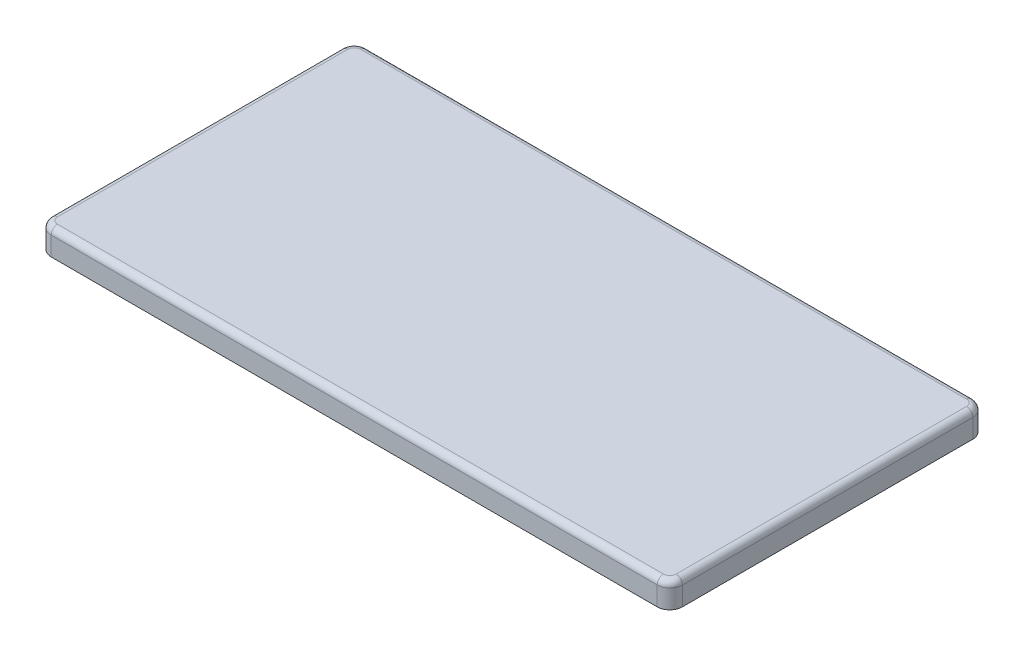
ISO-10303-21;
HEADER;
FILE_DESCRIPTION(('STEP AP214'),'2;1');
FILE_NAME('part.step','',(''),(''),'','','');
FILE_SCHEMA(('AUTOMOTIVE_DESIGN { 1 0 10303 214 1 1 1 1 }'));
ENDSEC;
DATA;
#1=APPLICATION_CONTEXT('core data for automotive mechanical design processes');
#2=APPLICATION_PROTOCOL_DEFINITION('international standard','automotive_design',2000,#1);
#3=PRODUCT_CONTEXT('',#1,'mechanical');
#4=PRODUCT('Part','Part','',(#3));
#5=PRODUCT_RELATED_PRODUCT_CATEGORY('part','',(#4));
#6=PRODUCT_DEFINITION_FORMATION('','',#4);
#7=PRODUCT_DEFINITION_CONTEXT('part definition',#1,'design');
#8=PRODUCT_DEFINITION('design','',#6,#7);
#9=PRODUCT_DEFINITION_SHAPE('','',#8);
#10=(LENGTH_UNIT() NAMED_UNIT(*) SI_UNIT(.MILLI.,.METRE.));
#11=(NAMED_UNIT(*) PLANE_ANGLE_UNIT() SI_UNIT($,.RADIAN.));
#12=(NAMED_UNIT(*) SI_UNIT($,.STERADIAN.) SOLID_ANGLE_UNIT());
#13=UNCERTAINTY_MEASURE_WITH_UNIT(LENGTH_MEASURE(1.E-05),#10,'distance_accuracy_value','');
#14=(GEOMETRIC_REPRESENTATION_CONTEXT(3) GLOBAL_UNCERTAINTY_ASSIGNED_CONTEXT((#13)) GLOBAL_UNIT_ASSIGNED_CONTEXT((#10,
#11,#12)) REPRESENTATION_CONTEXT('',''));
#15=CARTESIAN_POINT('',(0.,0.,0.));
#16=DIRECTION('',(0.,0.,1.));
#17=DIRECTION('',(1.,0.,0.));
#18=AXIS2_PLACEMENT_3D('',#15,#16,#17);
#19=CARTESIAN_POINT('',(-47.2,0.,22.2));
#20=DIRECTION('',(0.,-1.,0.));
#21=DIRECTION('',(0.,0.,-1.));
#22=AXIS2_PLACEMENT_3D('',#19,#20,#21);
#23=PLANE('',#22);
#24=DIRECTION('',(0.707106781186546,0.,0.707106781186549));
#25=VECTOR('',#24,1.);
#26=CARTESIAN_POINT('',(-29.2928932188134,0.,-3.7476659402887));
#27=LINE('',#26,#25);
#28=CARTESIAN_POINT('',(-29.2928932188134,0.,-3.7476659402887));
#29=VERTEX_POINT('',#28);
#30=CARTESIAN_POINT('',(-26.2523340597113,0.,-0.707106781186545));
#31=VERTEX_POINT('',#30);
#32=EDGE_CURVE('E283',#29,#31,#27,.T.);
#33=ORIENTED_EDGE('',*,*,#32,.F.);
#34=DIRECTION('',(0.707106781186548,0.,-0.707106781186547));
#35=VECTOR('',#34,1.);
#36=CARTESIAN_POINT('',(-33.7476659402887,0.,0.707106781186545));
#37=LINE('',#36,#35);
#38=CARTESIAN_POINT('',(-33.7476659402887,0.,0.707106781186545));
#39=VERTEX_POINT('',#38);
#40=EDGE_CURVE('E257',#39,#29,#37,.T.);
#41=ORIENTED_EDGE('',*,*,#40,.F.);
#42=DIRECTION('',(-0.707106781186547,0.,-0.707106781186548));
#43=VECTOR('',#42,1.);
#44=CARTESIAN_POINT('',(-33.7476659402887,0.,0.707106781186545));
#45=LINE('',#44,#43);
#46=CARTESIAN_POINT('',(-30.7071067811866,0.,3.7476659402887));
#47=VERTEX_POINT('',#46);
#48=EDGE_CURVE('E289',#47,#39,#45,.T.);
#49=ORIENTED_EDGE('',*,*,#48,.F.);
#50=DIRECTION('',(-0.707106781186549,0.,0.707106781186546));
#51=VECTOR('',#50,1.);
#52=CARTESIAN_POINT('',(-30.7071067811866,0.,3.7476659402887));
#53=LINE('',#52,#51);
#54=EDGE_CURVE('E286',#31,#47,#53,.T.);
#55=ORIENTED_EDGE('',*,*,#54,.F.);
#56=EDGE_LOOP('',(#33,#41,#49,#55));
#57=FACE_BOUND('',#56,.T.);
#58=CARTESIAN_POINT('',(-47.2,0.,22.2));
#59=DIRECTION('',(0.,-1.,0.));
#60=DIRECTION('',(0.,0.,-1.));
#61=AXIS2_PLACEMENT_3D('',#58,#59,#60);
#62=CIRCLE('',#61,0.8);
#63=CARTESIAN_POINT('',(-47.2,0.,23.));
#64=VERTEX_POINT('',#63);
#65=CARTESIAN_POINT('',(-48.,0.,22.2));
#66=VERTEX_POINT('',#65);
#67=EDGE_CURVE('E301',#64,#66,#62,.T.);
#68=ORIENTED_EDGE('',*,*,#67,.T.);
#69=DIRECTION('',(0.,0.,-1.));
#70=VECTOR('',#69,1.);
#71=CARTESIAN_POINT('',(-48.,0.,22.2));
#72=LINE('',#71,#70);
#73=CARTESIAN_POINT('',(-48.,0.,-22.2));
#74=VERTEX_POINT('',#73);
#75=EDGE_CURVE('E304',#66,#74,#72,.T.);
#76=ORIENTED_EDGE('',*,*,#75,.T.);
#77=CARTESIAN_POINT('',(-47.2,0.,-22.2));
#78=DIRECTION('',(0.,-1.,0.));
#79=DIRECTION('',(0.,0.,-1.));
#80=AXIS2_PLACEMENT_3D('',#77,#78,#79);
#81=CIRCLE('',#80,0.800000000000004);
#82=CARTESIAN_POINT('',(-47.2,0.,-23.));
#83=VERTEX_POINT('',#82);
#84=EDGE_CURVE('E308',#74,#83,#81,.T.);
#85=ORIENTED_EDGE('',*,*,#84,.T.);
#86=DIRECTION('',(1.,0.,0.));
#87=VECTOR('',#86,1.);
#88=CARTESIAN_POINT('',(-47.2,0.,-23.));
#89=LINE('',#88,#87);
#90=CARTESIAN_POINT('',(47.2,0.,-23.));
#91=VERTEX_POINT('',#90);
#92=EDGE_CURVE('E311',#83,#91,#89,.T.);
#93=ORIENTED_EDGE('',*,*,#92,.T.);
#94=CARTESIAN_POINT('',(47.2,0.,-22.2));
#95=DIRECTION('',(0.,-1.,0.));
#96=DIRECTION('',(0.,0.,-1.));
#97=AXIS2_PLACEMENT_3D('',#94,#95,#96);
#98=CIRCLE('',#97,0.800000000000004);
#99=CARTESIAN_POINT('',(48.,0.,-22.2));
#100=VERTEX_POINT('',#99);
#101=EDGE_CURVE('E314',#91,#100,#98,.T.);
#102=ORIENTED_EDGE('',*,*,#101,.T.);
#103=DIRECTION('',(0.,0.,1.));
#104=VECTOR('',#103,1.);
#105=CARTESIAN_POINT('',(48.,0.,22.2));
#106=LINE('',#105,#104);
#107=CARTESIAN_POINT('',(48.,0.,22.2));
#108=VERTEX_POINT('',#107);
#109=EDGE_CURVE('E317',#100,#108,#106,.T.);
#110=ORIENTED_EDGE('',*,*,#109,.T.);
#111=CARTESIAN_POINT('',(47.2,0.,22.2));
#112=DIRECTION('',(0.,-1.,0.));
#113=DIRECTION('',(0.,0.,-1.));
#114=AXIS2_PLACEMENT_3D('',#111,#112,#113);
#115=CIRCLE('',#114,0.799999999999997);
#116=CARTESIAN_POINT('',(47.2,0.,23.));
#117=VERTEX_POINT('',#116);
#118=EDGE_CURVE('E320',#108,#117,#115,.T.);
#119=ORIENTED_EDGE('',*,*,#118,.T.);
#120=DIRECTION('',(-1.,0.,0.));
#121=VECTOR('',#120,1.);
#122=CARTESIAN_POINT('',(-47.2,0.,23.));
#123=LINE('',#122,#121);
#124=EDGE_CURVE('E323',#117,#64,#123,.T.);
#125=ORIENTED_EDGE('',*,*,#124,.T.);
#126=EDGE_LOOP('',(#68,#76,#85,#93,#102,#110,#119,#125));
#127=FACE_BOUND('',#126,.T.);
#128=DIRECTION('',(0.707106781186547,0.,0.707106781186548));
#129=VECTOR('',#128,1.);
#130=CARTESIAN_POINT('',(30.7071067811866,0.,-3.7476659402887));
#131=LINE('',#130,#129);
#132=CARTESIAN_POINT('',(30.7071067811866,0.,-3.7476659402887));
#133=VERTEX_POINT('',#132);
#134=CARTESIAN_POINT('',(33.7476659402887,0.,-0.707106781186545));
#135=VERTEX_POINT('',#134);
#136=EDGE_CURVE('E251',#133,#135,#131,.T.);
#137=ORIENTED_EDGE('',*,*,#136,.F.);
#138=DIRECTION('',(0.707106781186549,0.,-0.707106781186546));
#139=VECTOR('',#138,1.);
#140=CARTESIAN_POINT('',(26.2523340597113,0.,0.707106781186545));
#141=LINE('',#140,#139);
#142=CARTESIAN_POINT('',(26.2523340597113,0.,0.707106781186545));
#143=VERTEX_POINT('',#142);
#144=EDGE_CURVE('E261',#143,#133,#141,.T.);
#145=ORIENTED_EDGE('',*,*,#144,.F.);
#146=DIRECTION('',(-0.707106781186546,0.,-0.707106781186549));
#147=VECTOR('',#146,1.);
#148=CARTESIAN_POINT('',(26.2523340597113,0.,0.707106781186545));
#149=LINE('',#148,#147);
#150=CARTESIAN_POINT('',(29.2928932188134,0.,3.74766594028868));
#151=VERTEX_POINT('',#150);
#152=EDGE_CURVE('E273',#151,#143,#149,.T.);
#153=ORIENTED_EDGE('',*,*,#152,.F.);
#154=DIRECTION('',(-0.707106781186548,0.,0.707106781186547));
#155=VECTOR('',#154,1.);
#156=CARTESIAN_POINT('',(29.2928932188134,0.,3.7476659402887));
#157=LINE('',#156,#155);
#158=EDGE_CURVE('E271',#135,#151,#157,.T.);
#159=ORIENTED_EDGE('',*,*,#158,.F.);
#160=EDGE_LOOP('',(#137,#145,#153,#159));
#161=FACE_BOUND('',#160,.T.);
#162=ADVANCED_FACE('F36',(#57,#127,#161),#23,.T.);
#163=CARTESIAN_POINT('',(-48.,2.,-23.));
#164=DIRECTION('',(0.,-1.,0.));
#165=DIRECTION('',(0.,0.,-1.));
#166=AXIS2_PLACEMENT_3D('',#163,#164,#165);
#167=CYLINDRICAL_SURFACE('',#166,2.);
#168=DIRECTION('',(0.,-1.,0.));
#169=VECTOR('',#168,1.);
#170=CARTESIAN_POINT('',(-50.,2.,-23.));
#171=LINE('',#170,#169);
#172=CARTESIAN_POINT('',(-50.,1.,-23.));
#173=VERTEX_POINT('',#172);
#174=CARTESIAN_POINT('',(-50.,-2.,-23.));
#175=VERTEX_POINT('',#174);
#176=EDGE_CURVE('E404',#173,#175,#171,.T.);
#177=ORIENTED_EDGE('',*,*,#176,.F.);
#178=CARTESIAN_POINT('',(-48.,1.,-23.));
#179=DIRECTION('',(0.,1.,0.));
#180=DIRECTION('',(0.,0.,1.));
#181=AXIS2_PLACEMENT_3D('',#178,#179,#180);
#182=CIRCLE('',#181,2.);
#183=CARTESIAN_POINT('',(-48.,1.,-25.));
#184=VERTEX_POINT('',#183);
#185=EDGE_CURVE('E428',#173,#184,#182,.F.);
#186=ORIENTED_EDGE('',*,*,#185,.T.);
#187=DIRECTION('',(0.,-1.,0.));
#188=VECTOR('',#187,1.);
#189=CARTESIAN_POINT('',(-48.,2.,-25.));
#190=LINE('',#189,#188);
#191=CARTESIAN_POINT('',(-48.,-2.,-25.));
#192=VERTEX_POINT('',#191);
#193=EDGE_CURVE('E390',#184,#192,#190,.T.);
#194=ORIENTED_EDGE('',*,*,#193,.T.);
#195=CARTESIAN_POINT('',(-48.,-2.,-23.));
#196=DIRECTION('',(0.,1.,0.));
#197=DIRECTION('',(0.,0.,1.));
#198=AXIS2_PLACEMENT_3D('',#195,#196,#197);
#199=CIRCLE('',#198,2.);
#200=EDGE_CURVE('E365',#192,#175,#199,.T.);
#201=ORIENTED_EDGE('',*,*,#200,.T.);
#202=EDGE_LOOP('',(#177,#186,#194,#201));
#203=FACE_BOUND('',#202,.T.);
#204=ADVANCED_FACE('F544',(#203),#167,.T.);
#205=CARTESIAN_POINT('',(-50.,2.,23.));
#206=DIRECTION('',(1.,0.,0.));
#207=DIRECTION('',(0.,0.,-1.));
#208=AXIS2_PLACEMENT_3D('',#205,#206,#207);
#209=PLANE('',#208);
#210=DIRECTION('',(0.,-1.,0.));
#211=VECTOR('',#210,1.);
#212=CARTESIAN_POINT('',(-50.,2.,23.));
#213=LINE('',#212,#211);
#214=CARTESIAN_POINT('',(-50.,1.,23.));
#215=VERTEX_POINT('',#214);
#216=CARTESIAN_POINT('',(-50.,-2.,23.));
#217=VERTEX_POINT('',#216);
#218=EDGE_CURVE('E402',#215,#217,#213,.T.);
#219=ORIENTED_EDGE('',*,*,#218,.F.);
#220=DIRECTION('',(0.,0.,1.));
#221=VECTOR('',#220,1.);
#222=CARTESIAN_POINT('',(-50.,1.,-23.));
#223=LINE('',#222,#221);
#224=EDGE_CURVE('E426',#215,#173,#223,.F.);
#225=ORIENTED_EDGE('',*,*,#224,.T.);
#226=ORIENTED_EDGE('',*,*,#176,.T.);
#227=DIRECTION('',(0.,0.,1.));
#228=VECTOR('',#227,1.);
#229=CARTESIAN_POINT('',(-50.,-2.,23.));
#230=LINE('',#229,#228);
#231=EDGE_CURVE('E368',#175,#217,#230,.T.);
#232=ORIENTED_EDGE('',*,*,#231,.T.);
#233=EDGE_LOOP('',(#219,#225,#226,#232));
#234=FACE_BOUND('',#233,.T.);
#235=ADVANCED_FACE('F550',(#234),#209,.F.);
#236=CARTESIAN_POINT('',(-48.,2.,23.));
#237=DIRECTION('',(0.,-1.,0.));
#238=DIRECTION('',(0.,0.,-1.));
#239=AXIS2_PLACEMENT_3D('',#236,#237,#238);
#240=CYLINDRICAL_SURFACE('',#239,2.);
#241=DIRECTION('',(0.,-1.,0.));
#242=VECTOR('',#241,1.);
#243=CARTESIAN_POINT('',(-48.,2.,25.));
#244=LINE('',#243,#242);
#245=CARTESIAN_POINT('',(-48.,1.,25.));
#246=VERTEX_POINT('',#245);
#247=CARTESIAN_POINT('',(-48.,-2.,25.));
#248=VERTEX_POINT('',#247);
#249=EDGE_CURVE('E400',#246,#248,#244,.T.);
#250=ORIENTED_EDGE('',*,*,#249,.F.);
#251=CARTESIAN_POINT('',(-48.,1.,23.));
#252=DIRECTION('',(0.,1.,0.));
#253=DIRECTION('',(0.,0.,1.));
#254=AXIS2_PLACEMENT_3D('',#251,#252,#253);
#255=CIRCLE('',#254,2.);
#256=EDGE_CURVE('E423',#246,#215,#255,.F.);
#257=ORIENTED_EDGE('',*,*,#256,.T.);
#258=ORIENTED_EDGE('',*,*,#218,.T.);
#259=CARTESIAN_POINT('',(-48.,-2.,23.));
#260=DIRECTION('',(0.,1.,0.));
#261=DIRECTION('',(0.,0.,1.));
#262=AXIS2_PLACEMENT_3D('',#259,#260,#261);
#263=CIRCLE('',#262,2.);
#264=EDGE_CURVE('E372',#217,#248,#263,.T.);
#265=ORIENTED_EDGE('',*,*,#264,.T.);
#266=EDGE_LOOP('',(#250,#257,#258,#265));
#267=FACE_BOUND('',#266,.T.);
#268=ADVANCED_FACE('F620',(#267),#240,.T.);
#269=CARTESIAN_POINT('',(-48.,2.,25.));
#270=DIRECTION('',(0.,0.,-1.));
#271=DIRECTION('',(-1.,0.,0.));
#272=AXIS2_PLACEMENT_3D('',#269,#270,#271);
#273=PLANE('',#272);
#274=DIRECTION('',(0.,-1.,0.));
#275=VECTOR('',#274,1.);
#276=CARTESIAN_POINT('',(48.,2.,25.));
#277=LINE('',#276,#275);
#278=CARTESIAN_POINT('',(48.,1.,25.));
#279=VERTEX_POINT('',#278);
#280=CARTESIAN_POINT('',(48.,-2.,25.));
#281=VERTEX_POINT('',#280);
#282=EDGE_CURVE('E398',#279,#281,#277,.T.);
#283=ORIENTED_EDGE('',*,*,#282,.F.);
#284=DIRECTION('',(1.,0.,0.));
#285=VECTOR('',#284,1.);
#286=CARTESIAN_POINT('',(-48.,1.,25.));
#287=LINE('',#286,#285);
#288=EDGE_CURVE('E438',#279,#246,#287,.F.);
#289=ORIENTED_EDGE('',*,*,#288,.T.);
#290=ORIENTED_EDGE('',*,*,#249,.T.);
#291=DIRECTION('',(1.,0.,0.));
#292=VECTOR('',#291,1.);
#293=CARTESIAN_POINT('',(-48.,-2.,25.));
#294=LINE('',#293,#292);
#295=EDGE_CURVE('E375',#248,#281,#294,.T.);
#296=ORIENTED_EDGE('',*,*,#295,.T.);
#297=EDGE_LOOP('',(#283,#289,#290,#296));
#298=FACE_BOUND('',#297,.T.);
#299=ADVANCED_FACE('F616',(#298),#273,.F.);
#300=CARTESIAN_POINT('',(48.,2.,23.));
#301=DIRECTION('',(0.,-1.,0.));
#302=DIRECTION('',(0.,0.,-1.));
#303=AXIS2_PLACEMENT_3D('',#300,#301,#302);
#304=CYLINDRICAL_SURFACE('',#303,2.);
#305=DIRECTION('',(0.,-1.,0.));
#306=VECTOR('',#305,1.);
#307=CARTESIAN_POINT('',(50.,2.,23.));
#308=LINE('',#307,#306);
#309=CARTESIAN_POINT('',(50.,1.,23.));
#310=VERTEX_POINT('',#309);
#311=CARTESIAN_POINT('',(50.,-2.,23.));
#312=VERTEX_POINT('',#311);
#313=EDGE_CURVE('E396',#310,#312,#308,.T.);
#314=ORIENTED_EDGE('',*,*,#313,.F.);
#315=CARTESIAN_POINT('',(48.,1.,23.));
#316=DIRECTION('',(0.,1.,0.));
#317=DIRECTION('',(0.,0.,1.));
#318=AXIS2_PLACEMENT_3D('',#315,#316,#317);
#319=CIRCLE('',#318,2.);
#320=EDGE_CURVE('E436',#310,#279,#319,.F.);
#321=ORIENTED_EDGE('',*,*,#320,.T.);
#322=ORIENTED_EDGE('',*,*,#282,.T.);
#323=CARTESIAN_POINT('',(48.,-2.,23.));
#324=DIRECTION('',(0.,1.,0.));
#325=DIRECTION('',(0.,0.,1.));
#326=AXIS2_PLACEMENT_3D('',#323,#324,#325);
#327=CIRCLE('',#326,2.);
#328=EDGE_CURVE('E378',#281,#312,#327,.T.);
#329=ORIENTED_EDGE('',*,*,#328,.T.);
#330=EDGE_LOOP('',(#314,#321,#322,#329));
#331=FACE_BOUND('',#330,.T.);
#332=ADVANCED_FACE('F612',(#331),#304,.T.);
#333=CARTESIAN_POINT('',(50.,2.,23.));
#334=DIRECTION('',(-1.,0.,0.));
#335=DIRECTION('',(0.,0.,1.));
#336=AXIS2_PLACEMENT_3D('',#333,#334,#335);
#337=PLANE('',#336);
#338=DIRECTION('',(0.,-1.,0.));
#339=VECTOR('',#338,1.);
#340=CARTESIAN_POINT('',(50.,2.,-23.));
#341=LINE('',#340,#339);
#342=CARTESIAN_POINT('',(50.,1.,-23.));
#343=VERTEX_POINT('',#342);
#344=CARTESIAN_POINT('',(50.,-2.,-23.));
#345=VERTEX_POINT('',#344);
#346=EDGE_CURVE('E394',#343,#345,#341,.T.);
#347=ORIENTED_EDGE('',*,*,#346,.F.);
#348=DIRECTION('',(0.,0.,-1.));
#349=VECTOR('',#348,1.);
#350=CARTESIAN_POINT('',(50.,1.,23.));
#351=LINE('',#350,#349);
#352=EDGE_CURVE('E434',#343,#310,#351,.F.);
#353=ORIENTED_EDGE('',*,*,#352,.T.);
#354=ORIENTED_EDGE('',*,*,#313,.T.);
#355=DIRECTION('',(0.,0.,-1.));
#356=VECTOR('',#355,1.);
#357=CARTESIAN_POINT('',(50.,-2.,23.));
#358=LINE('',#357,#356);
#359=EDGE_CURVE('E381',#312,#345,#358,.T.);
#360=ORIENTED_EDGE('',*,*,#359,.T.);
#361=EDGE_LOOP('',(#347,#353,#354,#360));
#362=FACE_BOUND('',#361,.T.);
#363=ADVANCED_FACE('F608',(#362),#337,.F.);
#364=CARTESIAN_POINT('',(48.,2.,-23.));
#365=DIRECTION('',(0.,-1.,0.));
#366=DIRECTION('',(0.,0.,-1.));
#367=AXIS2_PLACEMENT_3D('',#364,#365,#366);
#368=CYLINDRICAL_SURFACE('',#367,2.);
#369=DIRECTION('',(0.,-1.,0.));
#370=VECTOR('',#369,1.);
#371=CARTESIAN_POINT('',(48.,2.,-25.));
#372=LINE('',#371,#370);
#373=CARTESIAN_POINT('',(48.,1.,-25.));
#374=VERTEX_POINT('',#373);
#375=CARTESIAN_POINT('',(48.,-2.,-25.));
#376=VERTEX_POINT('',#375);
#377=EDGE_CURVE('E392',#374,#376,#372,.T.);
#378=ORIENTED_EDGE('',*,*,#377,.F.);
#379=CARTESIAN_POINT('',(48.,1.,-23.));
#380=DIRECTION('',(0.,1.,0.));
#381=DIRECTION('',(0.,0.,1.));
#382=AXIS2_PLACEMENT_3D('',#379,#380,#381);
#383=CIRCLE('',#382,2.);
#384=EDGE_CURVE('E432',#374,#343,#383,.F.);
#385=ORIENTED_EDGE('',*,*,#384,.T.);
#386=ORIENTED_EDGE('',*,*,#346,.T.);
#387=CARTESIAN_POINT('',(48.,-2.,-23.));
#388=DIRECTION('',(0.,1.,0.));
#389=DIRECTION('',(0.,0.,1.));
#390=AXIS2_PLACEMENT_3D('',#387,#388,#389);
#391=CIRCLE('',#390,2.);
#392=EDGE_CURVE('E384',#345,#376,#391,.T.);
#393=ORIENTED_EDGE('',*,*,#392,.T.);
#394=EDGE_LOOP('',(#378,#385,#386,#393));
#395=FACE_BOUND('',#394,.T.);
#396=ADVANCED_FACE('F604',(#395),#368,.T.);
#397=CARTESIAN_POINT('',(-48.,2.,-25.));
#398=DIRECTION('',(0.,0.,1.));
#399=DIRECTION('',(1.,0.,0.));
#400=AXIS2_PLACEMENT_3D('',#397,#398,#399);
#401=PLANE('',#400);
#402=ORIENTED_EDGE('',*,*,#193,.F.);
#403=DIRECTION('',(-1.,0.,0.));
#404=VECTOR('',#403,1.);
#405=CARTESIAN_POINT('',(48.,1.,-25.));
#406=LINE('',#405,#404);
#407=EDGE_CURVE('E430',#184,#374,#406,.F.);
#408=ORIENTED_EDGE('',*,*,#407,.T.);
#409=ORIENTED_EDGE('',*,*,#377,.T.);
#410=DIRECTION('',(-1.,0.,0.));
#411=VECTOR('',#410,1.);
#412=CARTESIAN_POINT('',(-48.,-2.,-25.));
#413=LINE('',#412,#411);
#414=EDGE_CURVE('E387',#376,#192,#413,.T.);
#415=ORIENTED_EDGE('',*,*,#414,.T.);
#416=EDGE_LOOP('',(#402,#408,#409,#415));
#417=FACE_BOUND('',#416,.T.);
#418=ADVANCED_FACE('F596',(#417),#401,.F.);
#419=CARTESIAN_POINT('',(-48.,2.,-23.));
#420=DIRECTION('',(0.,1.,0.));
#421=DIRECTION('',(0.,0.,1.));
#422=AXIS2_PLACEMENT_3D('',#419,#420,#421);
#423=PLANE('',#422);
#424=DIRECTION('',(0.,0.,1.));
#425=VECTOR('',#424,1.);
#426=CARTESIAN_POINT('',(-49.,2.,23.));
#427=LINE('',#426,#425);
#428=CARTESIAN_POINT('',(-49.,2.,-23.));
#429=VERTEX_POINT('',#428);
#430=CARTESIAN_POINT('',(-49.,2.,23.));
#431=VERTEX_POINT('',#430);
#432=EDGE_CURVE('E418',#429,#431,#427,.T.);
#433=ORIENTED_EDGE('',*,*,#432,.T.);
#434=CARTESIAN_POINT('',(-48.,2.,23.));
#435=DIRECTION('',(0.,1.,0.));
#436=DIRECTION('',(0.,0.,1.));
#437=AXIS2_PLACEMENT_3D('',#434,#435,#436);
#438=CIRCLE('',#437,1.);
#439=CARTESIAN_POINT('',(-48.,2.,24.));
#440=VERTEX_POINT('',#439);
#441=EDGE_CURVE('E420',#431,#440,#438,.T.);
#442=ORIENTED_EDGE('',*,*,#441,.T.);
#443=DIRECTION('',(1.,0.,0.));
#444=VECTOR('',#443,1.);
#445=CARTESIAN_POINT('',(48.,2.,24.));
#446=LINE('',#445,#444);
#447=CARTESIAN_POINT('',(48.,2.,24.));
#448=VERTEX_POINT('',#447);
#449=EDGE_CURVE('E406',#440,#448,#446,.T.);
#450=ORIENTED_EDGE('',*,*,#449,.T.);
#451=CARTESIAN_POINT('',(48.,2.,23.));
#452=DIRECTION('',(0.,1.,0.));
#453=DIRECTION('',(0.,0.,1.));
#454=AXIS2_PLACEMENT_3D('',#451,#452,#453);
#455=CIRCLE('',#454,1.);
#456=CARTESIAN_POINT('',(49.,2.,23.));
#457=VERTEX_POINT('',#456);
#458=EDGE_CURVE('E408',#448,#457,#455,.T.);
#459=ORIENTED_EDGE('',*,*,#458,.T.);
#460=DIRECTION('',(0.,0.,-1.));
#461=VECTOR('',#460,1.);
#462=CARTESIAN_POINT('',(49.,2.,-23.));
#463=LINE('',#462,#461);
#464=CARTESIAN_POINT('',(49.,2.,-23.));
#465=VERTEX_POINT('',#464);
#466=EDGE_CURVE('E410',#457,#465,#463,.T.);
#467=ORIENTED_EDGE('',*,*,#466,.T.);
#468=CARTESIAN_POINT('',(48.,2.,-23.));
#469=DIRECTION('',(0.,1.,0.));
#470=DIRECTION('',(0.,0.,1.));
#471=AXIS2_PLACEMENT_3D('',#468,#469,#470);
#472=CIRCLE('',#471,1.);
#473=CARTESIAN_POINT('',(48.,2.,-24.));
#474=VERTEX_POINT('',#473);
#475=EDGE_CURVE('E412',#465,#474,#472,.T.);
#476=ORIENTED_EDGE('',*,*,#475,.T.);
#477=DIRECTION('',(-1.,0.,0.));
#478=VECTOR('',#477,1.);
#479=CARTESIAN_POINT('',(-48.,2.,-24.));
#480=LINE('',#479,#478);
#481=CARTESIAN_POINT('',(-48.,2.,-24.));
#482=VERTEX_POINT('',#481);
#483=EDGE_CURVE('E414',#474,#482,#480,.T.);
#484=ORIENTED_EDGE('',*,*,#483,.T.);
#485=CARTESIAN_POINT('',(-48.,2.,-23.));
#486=DIRECTION('',(0.,1.,0.));
#487=DIRECTION('',(0.,0.,1.));
#488=AXIS2_PLACEMENT_3D('',#485,#486,#487);
#489=CIRCLE('',#488,1.);
#490=EDGE_CURVE('E416',#482,#429,#489,.T.);
#491=ORIENTED_EDGE('',*,*,#490,.T.);
#492=EDGE_LOOP('',(#433,#442,#450,#459,#467,#476,#484,#491));
#493=FACE_BOUND('',#492,.T.);
#494=ADVANCED_FACE('F592',(#493),#423,.T.);
#495=CARTESIAN_POINT('',(-48.,-2.,-23.));
#496=DIRECTION('',(0.,1.,0.));
#497=DIRECTION('',(0.,0.,1.));
#498=AXIS2_PLACEMENT_3D('',#495,#496,#497);
#499=PLANE('',#498);
#500=DIRECTION('',(0.,0.,-1.));
#501=VECTOR('',#500,1.);
#502=CARTESIAN_POINT('',(-48.,-2.,22.2));
#503=LINE('',#502,#501);
#504=CARTESIAN_POINT('',(-48.,-2.,22.2));
#505=VERTEX_POINT('',#504);
#506=CARTESIAN_POINT('',(-48.,-2.,-22.2));
#507=VERTEX_POINT('',#506);
#508=EDGE_CURVE('E328',#505,#507,#503,.T.);
#509=ORIENTED_EDGE('',*,*,#508,.F.);
#510=CARTESIAN_POINT('',(-47.2,-2.,22.2));
#511=DIRECTION('',(0.,-1.,0.));
#512=DIRECTION('',(0.,0.,-1.));
#513=AXIS2_PLACEMENT_3D('',#510,#511,#512);
#514=CIRCLE('',#513,0.8);
#515=CARTESIAN_POINT('',(-47.2,-2.,23.));
#516=VERTEX_POINT('',#515);
#517=EDGE_CURVE('E295',#516,#505,#514,.T.);
#518=ORIENTED_EDGE('',*,*,#517,.F.);
#519=DIRECTION('',(-1.,0.,0.));
#520=VECTOR('',#519,1.);
#521=CARTESIAN_POINT('',(-47.2,-2.,23.));
#522=LINE('',#521,#520);
#523=CARTESIAN_POINT('',(47.2,-2.,23.));
#524=VERTEX_POINT('',#523);
#525=EDGE_CURVE('E305',#524,#516,#522,.T.);
#526=ORIENTED_EDGE('',*,*,#525,.F.);
#527=CARTESIAN_POINT('',(47.2,-2.,22.2));
#528=DIRECTION('',(0.,-1.,0.));
#529=DIRECTION('',(0.,0.,-1.));
#530=AXIS2_PLACEMENT_3D('',#527,#528,#529);
#531=CIRCLE('',#530,0.799999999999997);
#532=CARTESIAN_POINT('',(48.,-2.,22.2));
#533=VERTEX_POINT('',#532);
#534=EDGE_CURVE('E343',#533,#524,#531,.T.);
#535=ORIENTED_EDGE('',*,*,#534,.F.);
#536=DIRECTION('',(0.,0.,1.));
#537=VECTOR('',#536,1.);
#538=CARTESIAN_POINT('',(48.,-2.,22.2));
#539=LINE('',#538,#537);
#540=CARTESIAN_POINT('',(48.,-2.,-22.2));
#541=VERTEX_POINT('',#540);
#542=EDGE_CURVE('E340',#541,#533,#539,.T.);
#543=ORIENTED_EDGE('',*,*,#542,.F.);
#544=CARTESIAN_POINT('',(47.2,-2.,-22.2));
#545=DIRECTION('',(0.,-1.,0.));
#546=DIRECTION('',(0.,0.,-1.));
#547=AXIS2_PLACEMENT_3D('',#544,#545,#546);
#548=CIRCLE('',#547,0.800000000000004);
#549=CARTESIAN_POINT('',(47.2,-2.,-23.));
#550=VERTEX_POINT('',#549);
#551=EDGE_CURVE('E337',#550,#541,#548,.T.);
#552=ORIENTED_EDGE('',*,*,#551,.F.);
#553=DIRECTION('',(1.,0.,0.));
#554=VECTOR('',#553,1.);
#555=CARTESIAN_POINT('',(-47.2,-2.,-23.));
#556=LINE('',#555,#554);
#557=CARTESIAN_POINT('',(-47.2,-2.,-23.));
#558=VERTEX_POINT('',#557);
#559=EDGE_CURVE('E334',#558,#550,#556,.T.);
#560=ORIENTED_EDGE('',*,*,#559,.F.);
#561=CARTESIAN_POINT('',(-47.2,-2.,-22.2));
#562=DIRECTION('',(0.,-1.,0.));
#563=DIRECTION('',(0.,0.,-1.));
#564=AXIS2_PLACEMENT_3D('',#561,#562,#563);
#565=CIRCLE('',#564,0.800000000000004);
#566=EDGE_CURVE('E331',#507,#558,#565,.T.);
#567=ORIENTED_EDGE('',*,*,#566,.F.);
#568=EDGE_LOOP('',(#509,#518,#526,#535,#543,#552,#560,#567));
#569=FACE_BOUND('',#568,.T.);
#570=ORIENTED_EDGE('',*,*,#200,.F.);
#571=ORIENTED_EDGE('',*,*,#414,.F.);
#572=ORIENTED_EDGE('',*,*,#392,.F.);
#573=ORIENTED_EDGE('',*,*,#359,.F.);
#574=ORIENTED_EDGE('',*,*,#328,.F.);
#575=ORIENTED_EDGE('',*,*,#295,.F.);
#576=ORIENTED_EDGE('',*,*,#264,.F.);
#577=ORIENTED_EDGE('',*,*,#231,.F.);
#578=EDGE_LOOP('',(#570,#571,#572,#573,#574,#575,#576,#577));
#579=FACE_BOUND('',#578,.T.);
#580=ADVANCED_FACE('F595',(#569,#579),#499,.F.);
#581=CARTESIAN_POINT('',(48.,1.,-23.));
#582=DIRECTION('',(0.,1.,0.));
#583=DIRECTION('',(0.,0.,1.));
#584=AXIS2_PLACEMENT_3D('',#581,#582,#583);
#585=TOROIDAL_SURFACE('',#584,1.,1.);
#586=CARTESIAN_POINT('',(49.,1.,-23.));
#587=DIRECTION('',(0.,0.,1.));
#588=DIRECTION('',(1.,0.,0.));
#589=AXIS2_PLACEMENT_3D('',#586,#587,#588);
#590=CIRCLE('',#589,1.);
#591=EDGE_CURVE('E456',#343,#465,#590,.T.);
#592=ORIENTED_EDGE('',*,*,#591,.F.);
#593=ORIENTED_EDGE('',*,*,#384,.F.);
#594=CARTESIAN_POINT('',(48.,1.,-24.));
#595=DIRECTION('',(-1.,0.,0.));
#596=DIRECTION('',(0.,0.,1.));
#597=AXIS2_PLACEMENT_3D('',#594,#595,#596);
#598=CIRCLE('',#597,1.);
#599=EDGE_CURVE('E369',#474,#374,#598,.T.);
#600=ORIENTED_EDGE('',*,*,#599,.F.);
#601=ORIENTED_EDGE('',*,*,#475,.F.);
#602=EDGE_LOOP('',(#592,#593,#600,#601));
#603=FACE_BOUND('',#602,.T.);
#604=ADVANCED_FACE('F600',(#603),#585,.T.);
#605=CARTESIAN_POINT('',(-48.,1.,-24.));
#606=DIRECTION('',(1.,0.,0.));
#607=DIRECTION('',(0.,0.,-1.));
#608=AXIS2_PLACEMENT_3D('',#605,#606,#607);
#609=CYLINDRICAL_SURFACE('',#608,1.);
#610=ORIENTED_EDGE('',*,*,#599,.T.);
#611=ORIENTED_EDGE('',*,*,#407,.F.);
#612=CARTESIAN_POINT('',(-48.,1.,-24.));
#613=DIRECTION('',(-1.,0.,0.));
#614=DIRECTION('',(0.,0.,1.));
#615=AXIS2_PLACEMENT_3D('',#612,#613,#614);
#616=CIRCLE('',#615,1.);
#617=EDGE_CURVE('E453',#482,#184,#616,.T.);
#618=ORIENTED_EDGE('',*,*,#617,.F.);
#619=ORIENTED_EDGE('',*,*,#483,.F.);
#620=EDGE_LOOP('',(#610,#611,#618,#619));
#621=FACE_BOUND('',#620,.T.);
#622=ADVANCED_FACE('F650',(#621),#609,.T.);
#623=CARTESIAN_POINT('',(49.,1.,-23.));
#624=DIRECTION('',(0.,0.,1.));
#625=DIRECTION('',(1.,0.,0.));
#626=AXIS2_PLACEMENT_3D('',#623,#624,#625);
#627=CYLINDRICAL_SURFACE('',#626,1.);
#628=ORIENTED_EDGE('',*,*,#591,.T.);
#629=ORIENTED_EDGE('',*,*,#466,.F.);
#630=CARTESIAN_POINT('',(49.,1.,23.));
#631=DIRECTION('',(0.,0.,1.));
#632=DIRECTION('',(1.,0.,0.));
#633=AXIS2_PLACEMENT_3D('',#630,#631,#632);
#634=CIRCLE('',#633,1.);
#635=EDGE_CURVE('E450',#310,#457,#634,.T.);
#636=ORIENTED_EDGE('',*,*,#635,.F.);
#637=ORIENTED_EDGE('',*,*,#352,.F.);
#638=EDGE_LOOP('',(#628,#629,#636,#637));
#639=FACE_BOUND('',#638,.T.);
#640=ADVANCED_FACE('F646',(#639),#627,.T.);
#641=CARTESIAN_POINT('',(-48.,1.,-23.));
#642=DIRECTION('',(0.,1.,0.));
#643=DIRECTION('',(0.,0.,1.));
#644=AXIS2_PLACEMENT_3D('',#641,#642,#643);
#645=TOROIDAL_SURFACE('',#644,1.,1.);
#646=ORIENTED_EDGE('',*,*,#617,.T.);
#647=ORIENTED_EDGE('',*,*,#185,.F.);
#648=CARTESIAN_POINT('',(-49.,1.,-23.));
#649=DIRECTION('',(0.,0.,1.));
#650=DIRECTION('',(1.,0.,0.));
#651=AXIS2_PLACEMENT_3D('',#648,#649,#650);
#652=CIRCLE('',#651,1.);
#653=EDGE_CURVE('E447',#429,#173,#652,.T.);
#654=ORIENTED_EDGE('',*,*,#653,.F.);
#655=ORIENTED_EDGE('',*,*,#490,.F.);
#656=EDGE_LOOP('',(#646,#647,#654,#655));
#657=FACE_BOUND('',#656,.T.);
#658=ADVANCED_FACE('F642',(#657),#645,.T.);
#659=CARTESIAN_POINT('',(48.,1.,23.));
#660=DIRECTION('',(0.,1.,0.));
#661=DIRECTION('',(0.,0.,1.));
#662=AXIS2_PLACEMENT_3D('',#659,#660,#661);
#663=DEGENERATE_TOROIDAL_SURFACE('',#662,1.,1.,.T.);
#664=ORIENTED_EDGE('',*,*,#635,.T.);
#665=ORIENTED_EDGE('',*,*,#458,.F.);
#666=CARTESIAN_POINT('',(48.,1.,24.));
#667=DIRECTION('',(-1.,0.,0.));
#668=DIRECTION('',(0.,0.,1.));
#669=AXIS2_PLACEMENT_3D('',#666,#667,#668);
#670=CIRCLE('',#669,1.);
#671=EDGE_CURVE('E444',#279,#448,#670,.T.);
#672=ORIENTED_EDGE('',*,*,#671,.F.);
#673=ORIENTED_EDGE('',*,*,#320,.F.);
#674=EDGE_LOOP('',(#664,#665,#672,#673));
#675=FACE_BOUND('',#674,.T.);
#676=ADVANCED_FACE('F638',(#675),#663,.T.);
#677=CARTESIAN_POINT('',(-49.,1.,-23.));
#678=DIRECTION('',(0.,0.,-1.));
#679=DIRECTION('',(-1.,0.,0.));
#680=AXIS2_PLACEMENT_3D('',#677,#678,#679);
#681=CYLINDRICAL_SURFACE('',#680,1.);
#682=ORIENTED_EDGE('',*,*,#653,.T.);
#683=ORIENTED_EDGE('',*,*,#224,.F.);
#684=CARTESIAN_POINT('',(-49.,1.,23.));
#685=DIRECTION('',(0.,0.,1.));
#686=DIRECTION('',(1.,0.,0.));
#687=AXIS2_PLACEMENT_3D('',#684,#685,#686);
#688=CIRCLE('',#687,1.);
#689=EDGE_CURVE('E442',#431,#215,#688,.T.);
#690=ORIENTED_EDGE('',*,*,#689,.F.);
#691=ORIENTED_EDGE('',*,*,#432,.F.);
#692=EDGE_LOOP('',(#682,#683,#690,#691));
#693=FACE_BOUND('',#692,.T.);
#694=ADVANCED_FACE('F634',(#693),#681,.T.);
#695=CARTESIAN_POINT('',(-48.,1.,24.));
#696=DIRECTION('',(-1.,0.,0.));
#697=DIRECTION('',(0.,0.,1.));
#698=AXIS2_PLACEMENT_3D('',#695,#696,#697);
#699=CYLINDRICAL_SURFACE('',#698,1.);
#700=ORIENTED_EDGE('',*,*,#671,.T.);
#701=ORIENTED_EDGE('',*,*,#449,.F.);
#702=CARTESIAN_POINT('',(-48.,1.,24.));
#703=DIRECTION('',(-1.,0.,0.));
#704=DIRECTION('',(0.,0.,1.));
#705=AXIS2_PLACEMENT_3D('',#702,#703,#704);
#706=CIRCLE('',#705,1.);
#707=EDGE_CURVE('E350',#246,#440,#706,.T.);
#708=ORIENTED_EDGE('',*,*,#707,.F.);
#709=ORIENTED_EDGE('',*,*,#288,.F.);
#710=EDGE_LOOP('',(#700,#701,#708,#709));
#711=FACE_BOUND('',#710,.T.);
#712=ADVANCED_FACE('F630',(#711),#699,.T.);
#713=CARTESIAN_POINT('',(-48.,1.,23.));
#714=DIRECTION('',(0.,1.,0.));
#715=DIRECTION('',(0.,0.,1.));
#716=AXIS2_PLACEMENT_3D('',#713,#714,#715);
#717=DEGENERATE_TOROIDAL_SURFACE('',#716,1.,1.,.T.);
#718=ORIENTED_EDGE('',*,*,#689,.T.);
#719=ORIENTED_EDGE('',*,*,#256,.F.);
#720=ORIENTED_EDGE('',*,*,#707,.T.);
#721=ORIENTED_EDGE('',*,*,#441,.F.);
#722=EDGE_LOOP('',(#718,#719,#720,#721));
#723=FACE_BOUND('',#722,.T.);
#724=ADVANCED_FACE('F590',(#723),#717,.T.);
#725=CARTESIAN_POINT('',(-47.2,0.,22.2));
#726=DIRECTION('',(0.,-1.,0.));
#727=DIRECTION('',(0.,0.,-1.));
#728=AXIS2_PLACEMENT_3D('',#725,#726,#727);
#729=CYLINDRICAL_SURFACE('',#728,0.8);
#730=ORIENTED_EDGE('',*,*,#517,.T.);
#731=DIRECTION('',(0.,-1.,0.));
#732=VECTOR('',#731,1.);
#733=CARTESIAN_POINT('',(-48.,0.,22.2));
#734=LINE('',#733,#732);
#735=EDGE_CURVE('E326',#66,#505,#734,.T.);
#736=ORIENTED_EDGE('',*,*,#735,.F.);
#737=ORIENTED_EDGE('',*,*,#67,.F.);
#738=DIRECTION('',(0.,-1.,0.));
#739=VECTOR('',#738,1.);
#740=CARTESIAN_POINT('',(-47.2,0.,23.));
#741=LINE('',#740,#739);
#742=EDGE_CURVE('E348',#64,#516,#741,.T.);
#743=ORIENTED_EDGE('',*,*,#742,.T.);
#744=EDGE_LOOP('',(#730,#736,#737,#743));
#745=FACE_BOUND('',#744,.T.);
#746=ADVANCED_FACE('F563',(#745),#729,.F.);
#747=CARTESIAN_POINT('',(-47.2,0.,23.));
#748=DIRECTION('',(0.,0.,1.));
#749=DIRECTION('',(1.,0.,0.));
#750=AXIS2_PLACEMENT_3D('',#747,#748,#749);
#751=PLANE('',#750);
#752=ORIENTED_EDGE('',*,*,#525,.T.);
#753=ORIENTED_EDGE('',*,*,#742,.F.);
#754=ORIENTED_EDGE('',*,*,#124,.F.);
#755=DIRECTION('',(0.,-1.,0.));
#756=VECTOR('',#755,1.);
#757=CARTESIAN_POINT('',(47.2,0.,23.));
#758=LINE('',#757,#756);
#759=EDGE_CURVE('E351',#117,#524,#758,.T.);
#760=ORIENTED_EDGE('',*,*,#759,.T.);
#761=EDGE_LOOP('',(#752,#753,#754,#760));
#762=FACE_BOUND('',#761,.T.);
#763=ADVANCED_FACE('F559',(#762),#751,.F.);
#764=CARTESIAN_POINT('',(47.2,0.,22.2));
#765=DIRECTION('',(0.,-1.,0.));
#766=DIRECTION('',(0.,0.,-1.));
#767=AXIS2_PLACEMENT_3D('',#764,#765,#766);
#768=CYLINDRICAL_SURFACE('',#767,0.799999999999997);
#769=ORIENTED_EDGE('',*,*,#534,.T.);
#770=ORIENTED_EDGE('',*,*,#759,.F.);
#771=ORIENTED_EDGE('',*,*,#118,.F.);
#772=DIRECTION('',(0.,-1.,0.));
#773=VECTOR('',#772,1.);
#774=CARTESIAN_POINT('',(48.,0.,22.2));
#775=LINE('',#774,#773);
#776=EDGE_CURVE('E353',#108,#533,#775,.T.);
#777=ORIENTED_EDGE('',*,*,#776,.T.);
#778=EDGE_LOOP('',(#769,#770,#771,#777));
#779=FACE_BOUND('',#778,.T.);
#780=ADVANCED_FACE('F562',(#779),#768,.F.);
#781=CARTESIAN_POINT('',(48.,0.,22.2));
#782=DIRECTION('',(1.,0.,0.));
#783=DIRECTION('',(0.,0.,-1.));
#784=AXIS2_PLACEMENT_3D('',#781,#782,#783);
#785=PLANE('',#784);
#786=ORIENTED_EDGE('',*,*,#542,.T.);
#787=ORIENTED_EDGE('',*,*,#776,.F.);
#788=ORIENTED_EDGE('',*,*,#109,.F.);
#789=DIRECTION('',(0.,-1.,0.));
#790=VECTOR('',#789,1.);
#791=CARTESIAN_POINT('',(48.,0.,-22.2));
#792=LINE('',#791,#790);
#793=EDGE_CURVE('E355',#100,#541,#792,.T.);
#794=ORIENTED_EDGE('',*,*,#793,.T.);
#795=EDGE_LOOP('',(#786,#787,#788,#794));
#796=FACE_BOUND('',#795,.T.);
#797=ADVANCED_FACE('F567',(#796),#785,.F.);
#798=CARTESIAN_POINT('',(47.2,0.,-22.2));
#799=DIRECTION('',(0.,-1.,0.));
#800=DIRECTION('',(0.,0.,-1.));
#801=AXIS2_PLACEMENT_3D('',#798,#799,#800);
#802=CYLINDRICAL_SURFACE('',#801,0.800000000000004);
#803=ORIENTED_EDGE('',*,*,#551,.T.);
#804=ORIENTED_EDGE('',*,*,#793,.F.);
#805=ORIENTED_EDGE('',*,*,#101,.F.);
#806=DIRECTION('',(0.,-1.,0.));
#807=VECTOR('',#806,1.);
#808=CARTESIAN_POINT('',(47.2,0.,-23.));
#809=LINE('',#808,#807);
#810=EDGE_CURVE('E357',#91,#550,#809,.T.);
#811=ORIENTED_EDGE('',*,*,#810,.T.);
#812=EDGE_LOOP('',(#803,#804,#805,#811));
#813=FACE_BOUND('',#812,.T.);
#814=ADVANCED_FACE('F571',(#813),#802,.F.);
#815=CARTESIAN_POINT('',(-47.2,0.,-23.));
#816=DIRECTION('',(0.,0.,-1.));
#817=DIRECTION('',(-1.,0.,0.));
#818=AXIS2_PLACEMENT_3D('',#815,#816,#817);
#819=PLANE('',#818);
#820=ORIENTED_EDGE('',*,*,#559,.T.);
#821=ORIENTED_EDGE('',*,*,#810,.F.);
#822=ORIENTED_EDGE('',*,*,#92,.F.);
#823=DIRECTION('',(0.,-1.,0.));
#824=VECTOR('',#823,1.);
#825=CARTESIAN_POINT('',(-47.2,0.,-23.));
#826=LINE('',#825,#824);
#827=EDGE_CURVE('E359',#83,#558,#826,.T.);
#828=ORIENTED_EDGE('',*,*,#827,.T.);
#829=EDGE_LOOP('',(#820,#821,#822,#828));
#830=FACE_BOUND('',#829,.T.);
#831=ADVANCED_FACE('F575',(#830),#819,.F.);
#832=CARTESIAN_POINT('',(-47.2,0.,-22.2));
#833=DIRECTION('',(0.,-1.,0.));
#834=DIRECTION('',(0.,0.,-1.));
#835=AXIS2_PLACEMENT_3D('',#832,#833,#834);
#836=CYLINDRICAL_SURFACE('',#835,0.800000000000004);
#837=ORIENTED_EDGE('',*,*,#566,.T.);
#838=ORIENTED_EDGE('',*,*,#827,.F.);
#839=ORIENTED_EDGE('',*,*,#84,.F.);
#840=DIRECTION('',(0.,-1.,0.));
#841=VECTOR('',#840,1.);
#842=CARTESIAN_POINT('',(-48.,0.,-22.2));
#843=LINE('',#842,#841);
#844=EDGE_CURVE('E361',#74,#507,#843,.T.);
#845=ORIENTED_EDGE('',*,*,#844,.T.);
#846=EDGE_LOOP('',(#837,#838,#839,#845));
#847=FACE_BOUND('',#846,.T.);
#848=ADVANCED_FACE('F579',(#847),#836,.F.);
#849=CARTESIAN_POINT('',(-48.,0.,22.2));
#850=DIRECTION('',(-1.,0.,0.));
#851=DIRECTION('',(0.,0.,1.));
#852=AXIS2_PLACEMENT_3D('',#849,#850,#851);
#853=PLANE('',#852);
#854=ORIENTED_EDGE('',*,*,#508,.T.);
#855=ORIENTED_EDGE('',*,*,#844,.F.);
#856=ORIENTED_EDGE('',*,*,#75,.F.);
#857=ORIENTED_EDGE('',*,*,#735,.T.);
#858=EDGE_LOOP('',(#854,#855,#856,#857));
#859=FACE_BOUND('',#858,.T.);
#860=ADVANCED_FACE('F583',(#859),#853,.F.);
#861=CARTESIAN_POINT('',(-33.7476659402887,0.,0.707106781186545));
#862=DIRECTION('',(-0.707079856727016,-0.00872653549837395,-0.707079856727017));
#863=DIRECTION('',(-0.707106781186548,0.,0.707106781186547));
#864=AXIS2_PLACEMENT_3D('',#861,#862,#863);
#865=PLANE('',#864);
#866=DIRECTION('',(0.,0.999923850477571,-0.01234071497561));
#867=VECTOR('',#866,1.);
#868=CARTESIAN_POINT('',(-29.2928932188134,0.,-3.7476659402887));
#869=LINE('',#868,#867);
#870=CARTESIAN_POINT('',(-29.2928932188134,-10.2069812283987,-3.62169490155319));
#871=VERTEX_POINT('',#870);
#872=EDGE_CURVE('E293',#871,#29,#869,.T.);
#873=ORIENTED_EDGE('',*,*,#872,.F.);
#874=DIRECTION('',(0.707106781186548,0.,-0.707106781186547));
#875=VECTOR('',#874,1.);
#876=CARTESIAN_POINT('',(-33.6168013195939,-10.2069812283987,0.702213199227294));
#877=LINE('',#876,#875);
#878=CARTESIAN_POINT('',(-33.6216949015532,-10.2069812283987,0.707106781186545));
#879=VERTEX_POINT('',#878);
#880=EDGE_CURVE('E11',#871,#879,#877,.F.);
#881=ORIENTED_EDGE('',*,*,#880,.T.);
#882=DIRECTION('',(-0.01234071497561,0.999923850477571,0.));
#883=VECTOR('',#882,1.);
#884=CARTESIAN_POINT('',(-33.7476659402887,0.,0.707106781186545));
#885=LINE('',#884,#883);
#886=EDGE_CURVE('E292',#879,#39,#885,.T.);
#887=ORIENTED_EDGE('',*,*,#886,.T.);
#888=ORIENTED_EDGE('',*,*,#40,.T.);
#889=EDGE_LOOP('',(#873,#881,#887,#888));
#890=FACE_BOUND('',#889,.T.);
#891=ADVANCED_FACE('F521',(#890),#865,.T.);
#892=CARTESIAN_POINT('',(-29.2928932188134,0.,-3.7476659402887));
#893=DIRECTION('',(0.707079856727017,-0.00872653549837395,-0.707079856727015));
#894=DIRECTION('',(-0.707106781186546,0.,-0.707106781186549));
#895=AXIS2_PLACEMENT_3D('',#892,#893,#894);
#896=PLANE('',#895);
#897=DIRECTION('',(0.01234071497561,0.999923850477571,0.));
#898=VECTOR('',#897,1.);
#899=CARTESIAN_POINT('',(-26.2530124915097,-0.0549708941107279,-0.707106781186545));
#900=LINE('',#899,#898);
#901=CARTESIAN_POINT('',(-26.3783050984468,-10.2069812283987,-0.707106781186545));
#902=VERTEX_POINT('',#901);
#903=EDGE_CURVE('E296',#902,#31,#900,.T.);
#904=ORIENTED_EDGE('',*,*,#903,.F.);
#905=DIRECTION('',(0.707106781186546,0.,0.707106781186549));
#906=VECTOR('',#905,1.);
#907=CARTESIAN_POINT('',(-29.2879996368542,-10.2069812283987,-3.61680131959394));
#908=LINE('',#907,#906);
#909=EDGE_CURVE('E45',#902,#871,#908,.F.);
#910=ORIENTED_EDGE('',*,*,#909,.T.);
#911=ORIENTED_EDGE('',*,*,#872,.T.);
#912=ORIENTED_EDGE('',*,*,#32,.T.);
#913=EDGE_LOOP('',(#904,#910,#911,#912));
#914=FACE_BOUND('',#913,.T.);
#915=ADVANCED_FACE('F557',(#914),#896,.T.);
#916=CARTESIAN_POINT('',(-30.7071067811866,0.,3.7476659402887));
#917=DIRECTION('',(0.707079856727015,-0.00872653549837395,0.707079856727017));
#918=DIRECTION('',(0.707106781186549,0.,-0.707106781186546));
#919=AXIS2_PLACEMENT_3D('',#916,#917,#918);
#920=PLANE('',#919);
#921=DIRECTION('',(0.,0.999923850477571,0.01234071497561));
#922=VECTOR('',#921,1.);
#923=CARTESIAN_POINT('',(-30.7071067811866,-0.0375198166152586,3.74720288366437));
#924=LINE('',#923,#922);
#925=CARTESIAN_POINT('',(-30.7071067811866,-10.2069812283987,3.62169490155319));
#926=VERTEX_POINT('',#925);
#927=EDGE_CURVE('E298',#926,#47,#924,.T.);
#928=ORIENTED_EDGE('',*,*,#927,.F.);
#929=DIRECTION('',(-0.707106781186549,0.,0.707106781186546));
#930=VECTOR('',#929,1.);
#931=CARTESIAN_POINT('',(-26.3831986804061,-10.2069812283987,-0.702213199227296));
#932=LINE('',#931,#930);
#933=EDGE_CURVE('E60',#926,#902,#932,.F.);
#934=ORIENTED_EDGE('',*,*,#933,.T.);
#935=ORIENTED_EDGE('',*,*,#903,.T.);
#936=ORIENTED_EDGE('',*,*,#54,.T.);
#937=EDGE_LOOP('',(#928,#934,#935,#936));
#938=FACE_BOUND('',#937,.T.);
#939=ADVANCED_FACE('F539',(#938),#920,.T.);
#940=CARTESIAN_POINT('',(-33.7476659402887,0.,0.707106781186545));
#941=DIRECTION('',(-0.707079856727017,-0.00872653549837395,0.707079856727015));
#942=DIRECTION('',(0.707106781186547,0.,0.707106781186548));
#943=AXIS2_PLACEMENT_3D('',#940,#941,#942);
#944=PLANE('',#943);
#945=ORIENTED_EDGE('',*,*,#886,.F.);
#946=DIRECTION('',(-0.707106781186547,0.,-0.707106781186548));
#947=VECTOR('',#946,1.);
#948=CARTESIAN_POINT('',(-30.7120003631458,-10.2069812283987,3.61680131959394));
#949=LINE('',#948,#947);
#950=EDGE_CURVE('E486',#879,#926,#949,.F.);
#951=ORIENTED_EDGE('',*,*,#950,.T.);
#952=ORIENTED_EDGE('',*,*,#927,.T.);
#953=ORIENTED_EDGE('',*,*,#48,.T.);
#954=EDGE_LOOP('',(#945,#951,#952,#953));
#955=FACE_BOUND('',#954,.T.);
#956=ADVANCED_FACE('F524',(#955),#944,.T.);
#957=CARTESIAN_POINT('',(-29.2928932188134,-11.,-3.7476659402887));
#958=DIRECTION('',(0.,-1.,0.));
#959=DIRECTION('',(0.,0.,-1.));
#960=AXIS2_PLACEMENT_3D('',#957,#958,#959);
#961=PLANE('',#960);
#962=DIRECTION('',(0.707106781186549,0.,-0.707106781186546));
#963=VECTOR('',#962,1.);
#964=CARTESIAN_POINT('',(-31.2678770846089,-11.,3.05113743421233));
#965=LINE('',#964,#963);
#966=CARTESIAN_POINT('',(-27.50963286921,-11.,-0.707106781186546));
#967=VERTEX_POINT('',#966);
#968=CARTESIAN_POINT('',(-30.7071067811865,-11.,2.49036713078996));
#969=VERTEX_POINT('',#968);
#970=EDGE_CURVE('E481',#967,#969,#965,.F.);
#971=ORIENTED_EDGE('',*,*,#970,.T.);
#972=DIRECTION('',(0.707106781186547,0.,0.707106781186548));
#973=VECTOR('',#972,1.);
#974=CARTESIAN_POINT('',(-33.0511374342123,-11.,0.146336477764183));
#975=LINE('',#974,#973);
#976=CARTESIAN_POINT('',(-32.49036713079,-11.,0.707106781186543));
#977=VERTEX_POINT('',#976);
#978=EDGE_CURVE('E483',#969,#977,#975,.F.);
#979=ORIENTED_EDGE('',*,*,#978,.T.);
#980=DIRECTION('',(-0.707106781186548,0.,0.707106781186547));
#981=VECTOR('',#980,1.);
#982=CARTESIAN_POINT('',(-28.7321229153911,-11.,-3.05113743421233));
#983=LINE('',#982,#981);
#984=CARTESIAN_POINT('',(-29.2928932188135,-11.,-2.49036713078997));
#985=VERTEX_POINT('',#984);
#986=EDGE_CURVE('E477',#977,#985,#983,.F.);
#987=ORIENTED_EDGE('',*,*,#986,.T.);
#988=DIRECTION('',(-0.707106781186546,0.,-0.707106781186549));
#989=VECTOR('',#988,1.);
#990=CARTESIAN_POINT('',(-26.9488625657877,-11.,-0.146336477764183));
#991=LINE('',#990,#989);
#992=EDGE_CURVE('E479',#985,#967,#991,.F.);
#993=ORIENTED_EDGE('',*,*,#992,.T.);
#994=EDGE_LOOP('',(#971,#979,#987,#993));
#995=FACE_BOUND('',#994,.T.);
#996=ADVANCED_FACE('F531',(#995),#961,.T.);
#997=CARTESIAN_POINT('',(26.2523340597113,0.,0.707106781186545));
#998=DIRECTION('',(-0.707079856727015,-0.00872653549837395,-0.707079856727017));
#999=DIRECTION('',(-0.707106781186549,0.,0.707106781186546));
#1000=AXIS2_PLACEMENT_3D('',#997,#998,#999);
#1001=PLANE('',#1000);
#1002=DIRECTION('',(0.,0.999923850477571,-0.01234071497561));
#1003=VECTOR('',#1002,1.);
#1004=CARTESIAN_POINT('',(30.7071067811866,0.,-3.7476659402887));
#1005=LINE('',#1004,#1003);
#1006=CARTESIAN_POINT('',(30.7071067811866,-10.2069812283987,-3.62169490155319));
#1007=VERTEX_POINT('',#1006);
#1008=EDGE_CURVE('E246',#1007,#133,#1005,.T.);
#1009=ORIENTED_EDGE('',*,*,#1008,.F.);
#1010=DIRECTION('',(0.707106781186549,0.,-0.707106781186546));
#1011=VECTOR('',#1010,1.);
#1012=CARTESIAN_POINT('',(26.3831986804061,-10.2069812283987,0.702213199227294));
#1013=LINE('',#1012,#1011);
#1014=CARTESIAN_POINT('',(26.3783050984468,-10.2069812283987,0.707106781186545));
#1015=VERTEX_POINT('',#1014);
#1016=EDGE_CURVE('E475',#1007,#1015,#1013,.F.);
#1017=ORIENTED_EDGE('',*,*,#1016,.T.);
#1018=DIRECTION('',(-0.01234071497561,0.999923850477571,0.));
#1019=VECTOR('',#1018,1.);
#1020=CARTESIAN_POINT('',(26.2523340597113,0.,0.707106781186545));
#1021=LINE('',#1020,#1019);
#1022=EDGE_CURVE('E264',#1015,#143,#1021,.T.);
#1023=ORIENTED_EDGE('',*,*,#1022,.T.);
#1024=ORIENTED_EDGE('',*,*,#144,.T.);
#1025=EDGE_LOOP('',(#1009,#1017,#1023,#1024));
#1026=FACE_BOUND('',#1025,.T.);
#1027=ADVANCED_FACE('F262',(#1026),#1001,.T.);
#1028=CARTESIAN_POINT('',(30.7071067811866,0.,-3.7476659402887));
#1029=DIRECTION('',(0.707079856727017,-0.00872653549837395,-0.707079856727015));
#1030=DIRECTION('',(-0.707106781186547,0.,-0.707106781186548));
#1031=AXIS2_PLACEMENT_3D('',#1028,#1029,#1030);
#1032=PLANE('',#1031);
#1033=DIRECTION('',(0.01234071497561,0.999923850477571,0.));
#1034=VECTOR('',#1033,1.);
#1035=CARTESIAN_POINT('',(33.7469875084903,-0.0549708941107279,-0.707106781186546));
#1036=LINE('',#1035,#1034);
#1037=CARTESIAN_POINT('',(33.6216949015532,-10.2069812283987,-0.707106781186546));
#1038=VERTEX_POINT('',#1037);
#1039=EDGE_CURVE('E258',#1038,#135,#1036,.T.);
#1040=ORIENTED_EDGE('',*,*,#1039,.F.);
#1041=DIRECTION('',(0.707106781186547,0.,0.707106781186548));
#1042=VECTOR('',#1041,1.);
#1043=CARTESIAN_POINT('',(30.7120003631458,-10.2069812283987,-3.61680131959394));
#1044=LINE('',#1043,#1042);
#1045=EDGE_CURVE('E254',#1038,#1007,#1044,.F.);
#1046=ORIENTED_EDGE('',*,*,#1045,.T.);
#1047=ORIENTED_EDGE('',*,*,#1008,.T.);
#1048=ORIENTED_EDGE('',*,*,#136,.T.);
#1049=EDGE_LOOP('',(#1040,#1046,#1047,#1048));
#1050=FACE_BOUND('',#1049,.T.);
#1051=ADVANCED_FACE('F249',(#1050),#1032,.T.);
#1052=CARTESIAN_POINT('',(29.2928932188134,0.,3.7476659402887));
#1053=DIRECTION('',(0.707079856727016,-0.00872653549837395,0.707079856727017));
#1054=DIRECTION('',(0.707106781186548,0.,-0.707106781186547));
#1055=AXIS2_PLACEMENT_3D('',#1052,#1053,#1054);
#1056=PLANE('',#1055);
#1057=DIRECTION('',(0.,0.999923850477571,0.01234071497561));
#1058=VECTOR('',#1057,1.);
#1059=CARTESIAN_POINT('',(29.2928932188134,-0.0375198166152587,3.74720288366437));
#1060=LINE('',#1059,#1058);
#1061=CARTESIAN_POINT('',(29.2928932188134,-10.2069812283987,3.62169490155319));
#1062=VERTEX_POINT('',#1061);
#1063=EDGE_CURVE('E278',#1062,#151,#1060,.T.);
#1064=ORIENTED_EDGE('',*,*,#1063,.F.);
#1065=DIRECTION('',(-0.707106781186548,0.,0.707106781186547));
#1066=VECTOR('',#1065,1.);
#1067=CARTESIAN_POINT('',(33.6168013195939,-10.2069812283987,-0.702213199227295));
#1068=LINE('',#1067,#1066);
#1069=EDGE_CURVE('E472',#1062,#1038,#1068,.F.);
#1070=ORIENTED_EDGE('',*,*,#1069,.T.);
#1071=ORIENTED_EDGE('',*,*,#1039,.T.);
#1072=ORIENTED_EDGE('',*,*,#158,.T.);
#1073=EDGE_LOOP('',(#1064,#1070,#1071,#1072));
#1074=FACE_BOUND('',#1073,.T.);
#1075=ADVANCED_FACE('F714',(#1074),#1056,.T.);
#1076=CARTESIAN_POINT('',(26.2523340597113,0.,0.707106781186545));
#1077=DIRECTION('',(-0.707079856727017,-0.00872653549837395,0.707079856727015));
#1078=DIRECTION('',(0.707106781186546,0.,0.707106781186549));
#1079=AXIS2_PLACEMENT_3D('',#1076,#1077,#1078);
#1080=PLANE('',#1079);
#1081=ORIENTED_EDGE('',*,*,#1022,.F.);
#1082=DIRECTION('',(-0.707106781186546,0.,-0.707106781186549));
#1083=VECTOR('',#1082,1.);
#1084=CARTESIAN_POINT('',(29.2879996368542,-10.2069812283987,3.61680131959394));
#1085=LINE('',#1084,#1083);
#1086=EDGE_CURVE('E469',#1015,#1062,#1085,.F.);
#1087=ORIENTED_EDGE('',*,*,#1086,.T.);
#1088=ORIENTED_EDGE('',*,*,#1063,.T.);
#1089=ORIENTED_EDGE('',*,*,#152,.T.);
#1090=EDGE_LOOP('',(#1081,#1087,#1088,#1089));
#1091=FACE_BOUND('',#1090,.T.);
#1092=ADVANCED_FACE('F706',(#1091),#1080,.T.);
#1093=CARTESIAN_POINT('',(30.7071067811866,-11.,-3.7476659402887));
#1094=DIRECTION('',(0.,-1.,0.));
#1095=DIRECTION('',(0.,0.,-1.));
#1096=AXIS2_PLACEMENT_3D('',#1093,#1094,#1095);
#1097=PLANE('',#1096);
#1098=DIRECTION('',(0.707106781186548,0.,-0.707106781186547));
#1099=VECTOR('',#1098,1.);
#1100=CARTESIAN_POINT('',(28.7321229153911,-11.,3.05113743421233));
#1101=LINE('',#1100,#1099);
#1102=CARTESIAN_POINT('',(32.49036713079,-11.,-0.707106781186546));
#1103=VERTEX_POINT('',#1102);
#1104=CARTESIAN_POINT('',(29.2928932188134,-11.,2.49036713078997));
#1105=VERTEX_POINT('',#1104);
#1106=EDGE_CURVE('E464',#1103,#1105,#1101,.F.);
#1107=ORIENTED_EDGE('',*,*,#1106,.T.);
#1108=DIRECTION('',(0.707106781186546,0.,0.707106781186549));
#1109=VECTOR('',#1108,1.);
#1110=CARTESIAN_POINT('',(26.9488625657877,-11.,0.146336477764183));
#1111=LINE('',#1110,#1109);
#1112=CARTESIAN_POINT('',(27.50963286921,-11.,0.707106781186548));
#1113=VERTEX_POINT('',#1112);
#1114=EDGE_CURVE('E466',#1105,#1113,#1111,.F.);
#1115=ORIENTED_EDGE('',*,*,#1114,.T.);
#1116=DIRECTION('',(-0.707106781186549,0.,0.707106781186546));
#1117=VECTOR('',#1116,1.);
#1118=CARTESIAN_POINT('',(31.2678770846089,-11.,-3.05113743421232));
#1119=LINE('',#1118,#1117);
#1120=CARTESIAN_POINT('',(30.7071067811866,-11.,-2.49036713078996));
#1121=VERTEX_POINT('',#1120);
#1122=EDGE_CURVE('E440',#1113,#1121,#1119,.F.);
#1123=ORIENTED_EDGE('',*,*,#1122,.T.);
#1124=DIRECTION('',(-0.707106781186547,0.,-0.707106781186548));
#1125=VECTOR('',#1124,1.);
#1126=CARTESIAN_POINT('',(33.0511374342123,-11.,-0.146336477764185));
#1127=LINE('',#1126,#1125);
#1128=EDGE_CURVE('E462',#1121,#1103,#1127,.F.);
#1129=ORIENTED_EDGE('',*,*,#1128,.T.);
#1130=EDGE_LOOP('',(#1107,#1115,#1123,#1129));
#1131=FACE_BOUND('',#1130,.T.);
#1132=ADVANCED_FACE('F673',(#1131),#1097,.T.);
#1133=CARTESIAN_POINT('',(30.0784573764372,-10.2,-3.11901653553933));
#1134=DIRECTION('',(0.707106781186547,0.,0.707106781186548));
#1135=DIRECTION('',(0.707106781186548,0.,-0.707106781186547));
#1136=AXIS2_PLACEMENT_3D('',#1133,#1134,#1135);
#1137=CYLINDRICAL_SURFACE('',#1136,0.8);
#1138=CARTESIAN_POINT('',(30.7071067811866,-10.2,-2.49036713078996));
#1139=DIRECTION('',(1.,0.,0.));
#1140=DIRECTION('',(0.,0.,-1.));
#1141=AXIS2_PLACEMENT_3D('',#1138,#1139,#1140);
#1142=ELLIPSE('',#1141,1.13137084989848,0.8);
#1143=EDGE_CURVE('E495',#1007,#1121,#1142,.F.);
#1144=ORIENTED_EDGE('',*,*,#1143,.F.);
#1145=ORIENTED_EDGE('',*,*,#1045,.F.);
#1146=CARTESIAN_POINT('',(32.49036713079,-10.2,-0.707106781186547));
#1147=DIRECTION('',(0.,0.,1.));
#1148=DIRECTION('',(1.,0.,0.));
#1149=AXIS2_PLACEMENT_3D('',#1146,#1147,#1148);
#1150=ELLIPSE('',#1149,1.13137084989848,0.8);
#1151=EDGE_CURVE('E268',#1103,#1038,#1150,.T.);
#1152=ORIENTED_EDGE('',*,*,#1151,.F.);
#1153=ORIENTED_EDGE('',*,*,#1128,.F.);
#1154=EDGE_LOOP('',(#1144,#1145,#1152,#1153));
#1155=FACE_BOUND('',#1154,.T.);
#1156=ADVANCED_FACE('F669',(#1155),#1137,.T.);
#1157=CARTESIAN_POINT('',(33.1190165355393,-10.2,-1.33575618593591));
#1158=DIRECTION('',(-0.707106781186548,0.,0.707106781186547));
#1159=DIRECTION('',(0.707106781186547,0.,0.707106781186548));
#1160=AXIS2_PLACEMENT_3D('',#1157,#1158,#1159);
#1161=CYLINDRICAL_SURFACE('',#1160,0.8);
#1162=ORIENTED_EDGE('',*,*,#1151,.T.);
#1163=ORIENTED_EDGE('',*,*,#1069,.F.);
#1164=CARTESIAN_POINT('',(29.2928932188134,-10.2,2.49036713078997));
#1165=DIRECTION('',(-1.,0.,0.));
#1166=DIRECTION('',(0.,0.,1.));
#1167=AXIS2_PLACEMENT_3D('',#1164,#1165,#1166);
#1168=ELLIPSE('',#1167,1.13137084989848,0.8);
#1169=EDGE_CURVE('E493',#1105,#1062,#1168,.T.);
#1170=ORIENTED_EDGE('',*,*,#1169,.F.);
#1171=ORIENTED_EDGE('',*,*,#1106,.F.);
#1172=EDGE_LOOP('',(#1162,#1163,#1170,#1171));
#1173=FACE_BOUND('',#1172,.T.);
#1174=ADVANCED_FACE('F665',(#1173),#1161,.T.);
#1175=CARTESIAN_POINT('',(31.3357561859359,-10.2,-3.11901653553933));
#1176=DIRECTION('',(0.707106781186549,0.,-0.707106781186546));
#1177=DIRECTION('',(-0.707106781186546,0.,-0.707106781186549));
#1178=AXIS2_PLACEMENT_3D('',#1175,#1176,#1177);
#1179=CYLINDRICAL_SURFACE('',#1178,0.8);
#1180=ORIENTED_EDGE('',*,*,#1143,.T.);
#1181=ORIENTED_EDGE('',*,*,#1122,.F.);
#1182=CARTESIAN_POINT('',(27.50963286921,-10.2,0.707106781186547));
#1183=DIRECTION('',(0.,0.,-1.));
#1184=DIRECTION('',(1.,0.,0.));
#1185=AXIS2_PLACEMENT_3D('',#1182,#1183,#1184);
#1186=ELLIPSE('',#1185,1.13137084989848,0.8);
#1187=EDGE_CURVE('E491',#1015,#1113,#1186,.F.);
#1188=ORIENTED_EDGE('',*,*,#1187,.F.);
#1189=ORIENTED_EDGE('',*,*,#1016,.F.);
#1190=EDGE_LOOP('',(#1180,#1181,#1188,#1189));
#1191=FACE_BOUND('',#1190,.T.);
#1192=ADVANCED_FACE('F661',(#1191),#1179,.T.);
#1193=CARTESIAN_POINT('',(26.8809834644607,-10.2,0.0784573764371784));
#1194=DIRECTION('',(-0.707106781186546,0.,-0.707106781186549));
#1195=DIRECTION('',(-0.707106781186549,0.,0.707106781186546));
#1196=AXIS2_PLACEMENT_3D('',#1193,#1194,#1195);
#1197=CYLINDRICAL_SURFACE('',#1196,0.8);
#1198=ORIENTED_EDGE('',*,*,#1169,.T.);
#1199=ORIENTED_EDGE('',*,*,#1086,.F.);
#1200=ORIENTED_EDGE('',*,*,#1187,.T.);
#1201=ORIENTED_EDGE('',*,*,#1114,.F.);
#1202=EDGE_LOOP('',(#1198,#1199,#1200,#1201));
#1203=FACE_BOUND('',#1202,.T.);
#1204=ADVANCED_FACE('F658',(#1203),#1197,.T.);
#1205=CARTESIAN_POINT('',(-29.9215426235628,-10.2,-3.11901653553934));
#1206=DIRECTION('',(0.707106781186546,0.,0.707106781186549));
#1207=DIRECTION('',(0.707106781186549,0.,-0.707106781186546));
#1208=AXIS2_PLACEMENT_3D('',#1205,#1206,#1207);
#1209=CYLINDRICAL_SURFACE('',#1208,0.8);
#1210=CARTESIAN_POINT('',(-29.2928932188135,-10.2,-2.49036713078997));
#1211=DIRECTION('',(1.,0.,0.));
#1212=DIRECTION('',(0.,0.,-1.));
#1213=AXIS2_PLACEMENT_3D('',#1210,#1211,#1212);
#1214=ELLIPSE('',#1213,1.13137084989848,0.8);
#1215=EDGE_CURVE('E503',#871,#985,#1214,.F.);
#1216=ORIENTED_EDGE('',*,*,#1215,.F.);
#1217=ORIENTED_EDGE('',*,*,#909,.F.);
#1218=CARTESIAN_POINT('',(-27.50963286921,-10.2,-0.707106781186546));
#1219=DIRECTION('',(0.,0.,1.));
#1220=DIRECTION('',(1.,0.,0.));
#1221=AXIS2_PLACEMENT_3D('',#1218,#1219,#1220);
#1222=ELLIPSE('',#1221,1.13137084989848,0.8);
#1223=EDGE_CURVE('E40',#967,#902,#1222,.T.);
#1224=ORIENTED_EDGE('',*,*,#1223,.F.);
#1225=ORIENTED_EDGE('',*,*,#992,.F.);
#1226=EDGE_LOOP('',(#1216,#1217,#1224,#1225));
#1227=FACE_BOUND('',#1226,.T.);
#1228=ADVANCED_FACE('F38',(#1227),#1209,.T.);
#1229=CARTESIAN_POINT('',(-26.8809834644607,-10.2,-1.33575618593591));
#1230=DIRECTION('',(-0.707106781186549,0.,0.707106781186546));
#1231=DIRECTION('',(0.707106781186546,0.,0.707106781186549));
#1232=AXIS2_PLACEMENT_3D('',#1229,#1230,#1231);
#1233=CYLINDRICAL_SURFACE('',#1232,0.8);
#1234=ORIENTED_EDGE('',*,*,#1223,.T.);
#1235=ORIENTED_EDGE('',*,*,#933,.F.);
#1236=CARTESIAN_POINT('',(-30.7071067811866,-10.2,2.49036713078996));
#1237=DIRECTION('',(-1.,0.,0.));
#1238=DIRECTION('',(0.,0.,1.));
#1239=AXIS2_PLACEMENT_3D('',#1236,#1237,#1238);
#1240=ELLIPSE('',#1239,1.13137084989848,0.8);
#1241=EDGE_CURVE('E502',#969,#926,#1240,.T.);
#1242=ORIENTED_EDGE('',*,*,#1241,.F.);
#1243=ORIENTED_EDGE('',*,*,#970,.F.);
#1244=EDGE_LOOP('',(#1234,#1235,#1242,#1243));
#1245=FACE_BOUND('',#1244,.T.);
#1246=ADVANCED_FACE('F513',(#1245),#1233,.T.);
#1247=CARTESIAN_POINT('',(-28.6642438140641,-10.2,-3.11901653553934));
#1248=DIRECTION('',(0.707106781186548,0.,-0.707106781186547));
#1249=DIRECTION('',(-0.707106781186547,0.,-0.707106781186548));
#1250=AXIS2_PLACEMENT_3D('',#1247,#1248,#1249);
#1251=CYLINDRICAL_SURFACE('',#1250,0.8);
#1252=ORIENTED_EDGE('',*,*,#1215,.T.);
#1253=ORIENTED_EDGE('',*,*,#986,.F.);
#1254=CARTESIAN_POINT('',(-32.49036713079,-10.2,0.707106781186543));
#1255=DIRECTION('',(0.,0.,-1.));
#1256=DIRECTION('',(1.,0.,0.));
#1257=AXIS2_PLACEMENT_3D('',#1254,#1255,#1256);
#1258=ELLIPSE('',#1257,1.13137084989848,0.8);
#1259=EDGE_CURVE('E500',#879,#977,#1258,.F.);
#1260=ORIENTED_EDGE('',*,*,#1259,.F.);
#1261=ORIENTED_EDGE('',*,*,#880,.F.);
#1262=EDGE_LOOP('',(#1252,#1253,#1260,#1261));
#1263=FACE_BOUND('',#1262,.T.);
#1264=ADVANCED_FACE('F518',(#1263),#1251,.T.);
#1265=CARTESIAN_POINT('',(-33.1190165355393,-10.2,0.0784573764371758));
#1266=DIRECTION('',(-0.707106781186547,0.,-0.707106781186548));
#1267=DIRECTION('',(-0.707106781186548,0.,0.707106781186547));
#1268=AXIS2_PLACEMENT_3D('',#1265,#1266,#1267);
#1269=CYLINDRICAL_SURFACE('',#1268,0.8);
#1270=ORIENTED_EDGE('',*,*,#1241,.T.);
#1271=ORIENTED_EDGE('',*,*,#950,.F.);
#1272=ORIENTED_EDGE('',*,*,#1259,.T.);
#1273=ORIENTED_EDGE('',*,*,#978,.F.);
#1274=EDGE_LOOP('',(#1270,#1271,#1272,#1273));
#1275=FACE_BOUND('',#1274,.T.);
#1276=ADVANCED_FACE('F528',(#1275),#1269,.T.);
#1277=CLOSED_SHELL('',(#162,#204,#235,#268,#299,#332,#363,#396,#418,#494,#580,#604,#622,#640,
#658,#676,#694,#712,#724,#746,#763,#780,#797,#814,#831,#848,#860,#891,#915,#939,#956,#996,#1027,
#1051,#1075,#1092,#1132,#1156,#1174,#1192,#1204,#1228,#1246,#1264,#1276));
#1278=MANIFOLD_SOLID_BREP('B2',#1277);
#1279=ADVANCED_BREP_SHAPE_REPRESENTATION('',(#18,#1278),#14);
#1280=SHAPE_DEFINITION_REPRESENTATION(#9,#1279);
ENDSEC;
END-ISO-10303-21;
